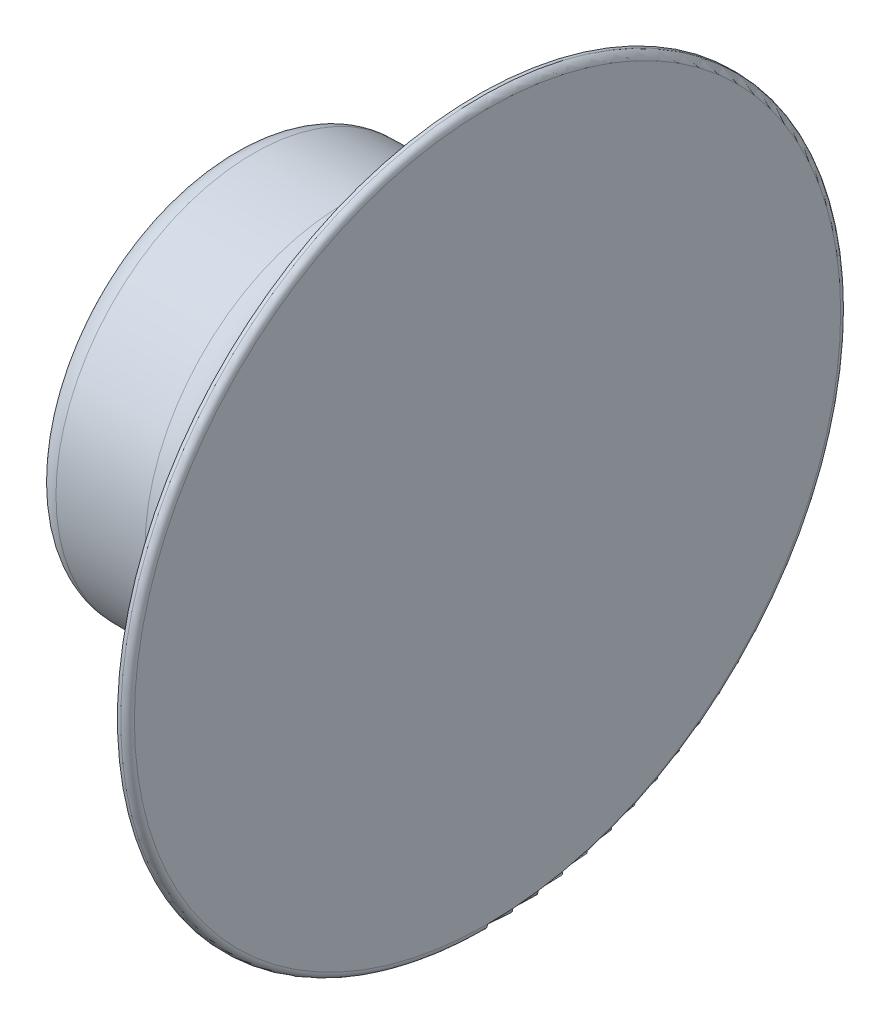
ISO-10303-21;
HEADER;
FILE_DESCRIPTION(('STEP AP214'),'2;1');
FILE_NAME('part.step','',(''),(''),'','','');
FILE_SCHEMA(('AUTOMOTIVE_DESIGN { 1 0 10303 214 1 1 1 1 }'));
ENDSEC;
DATA;
#1=APPLICATION_CONTEXT('core data for automotive mechanical design processes');
#2=APPLICATION_PROTOCOL_DEFINITION('international standard','automotive_design',2000,#1);
#3=PRODUCT_CONTEXT('',#1,'mechanical');
#4=PRODUCT('Part','Part','',(#3));
#5=PRODUCT_RELATED_PRODUCT_CATEGORY('part','',(#4));
#6=PRODUCT_DEFINITION_FORMATION('','',#4);
#7=PRODUCT_DEFINITION_CONTEXT('part definition',#1,'design');
#8=PRODUCT_DEFINITION('design','',#6,#7);
#9=PRODUCT_DEFINITION_SHAPE('','',#8);
#10=(LENGTH_UNIT() NAMED_UNIT(*) SI_UNIT(.MILLI.,.METRE.));
#11=(NAMED_UNIT(*) PLANE_ANGLE_UNIT() SI_UNIT($,.RADIAN.));
#12=(NAMED_UNIT(*) SI_UNIT($,.STERADIAN.) SOLID_ANGLE_UNIT());
#13=UNCERTAINTY_MEASURE_WITH_UNIT(LENGTH_MEASURE(1.E-05),#10,'distance_accuracy_value','');
#14=(GEOMETRIC_REPRESENTATION_CONTEXT(3) GLOBAL_UNCERTAINTY_ASSIGNED_CONTEXT((#13)) GLOBAL_UNIT_ASSIGNED_CONTEXT((#10,
#11,#12)) REPRESENTATION_CONTEXT('',''));
#15=CARTESIAN_POINT('',(0.,0.,0.));
#16=DIRECTION('',(0.,0.,1.));
#17=DIRECTION('',(1.,0.,0.));
#18=AXIS2_PLACEMENT_3D('',#15,#16,#17);
#19=CARTESIAN_POINT('',(0.,0.,0.));
#20=DIRECTION('',(1.,0.,0.));
#21=DIRECTION('',(0.,0.,-1.));
#22=AXIS2_PLACEMENT_3D('',#19,#20,#21);
#23=PLANE('',#22);
#24=CARTESIAN_POINT('',(0.,0.,0.));
#25=DIRECTION('',(1.,0.,0.));
#26=DIRECTION('',(0.,0.,-1.));
#27=AXIS2_PLACEMENT_3D('',#24,#25,#26);
#28=CIRCLE('',#27,13.208);
#29=CARTESIAN_POINT('',(0.,0.,-13.208));
#30=VERTEX_POINT('',#29);
#31=EDGE_CURVE('E22',#30,#30,#28,.T.);
#32=ORIENTED_EDGE('',*,*,#31,.T.);
#33=EDGE_LOOP('',(#32));
#34=FACE_BOUND('',#33,.T.);
#35=ADVANCED_FACE('F14',(#34),#23,.T.);
#36=CARTESIAN_POINT('',(0.,0.,0.));
#37=DIRECTION('',(1.,0.,0.));
#38=DIRECTION('',(0.,0.,-1.));
#39=AXIS2_PLACEMENT_3D('',#36,#37,#38);
#40=CYLINDRICAL_SURFACE('',#39,13.462);
#41=CARTESIAN_POINT('',(-0.254,0.,0.));
#42=DIRECTION('',(1.,0.,0.));
#43=DIRECTION('',(0.,0.,-1.));
#44=AXIS2_PLACEMENT_3D('',#41,#42,#43);
#45=CIRCLE('',#44,13.462);
#46=CARTESIAN_POINT('',(-0.254,0.,-13.462));
#47=VERTEX_POINT('',#46);
#48=EDGE_CURVE('E9',#47,#47,#45,.F.);
#49=ORIENTED_EDGE('',*,*,#48,.T.);
#50=EDGE_LOOP('',(#49));
#51=FACE_BOUND('',#50,.T.);
#52=CARTESIAN_POINT('',(-0.37846,0.,0.));
#53=DIRECTION('',(1.,0.,0.));
#54=DIRECTION('',(0.,0.,-1.));
#55=AXIS2_PLACEMENT_3D('',#52,#53,#54);
#56=CIRCLE('',#55,13.462);
#57=CARTESIAN_POINT('',(-0.37846,0.,-13.462));
#58=VERTEX_POINT('',#57);
#59=EDGE_CURVE('E50',#58,#58,#56,.T.);
#60=ORIENTED_EDGE('',*,*,#59,.T.);
#61=EDGE_LOOP('',(#60));
#62=FACE_BOUND('',#61,.T.);
#63=ADVANCED_FACE('F56',(#51,#62),#40,.T.);
#64=CARTESIAN_POINT('',(-0.37846,0.,0.));
#65=DIRECTION('',(1.,0.,0.));
#66=DIRECTION('',(0.,0.,-1.));
#67=AXIS2_PLACEMENT_3D('',#64,#65,#66);
#68=CONICAL_SURFACE('',#67,13.462,1.01219701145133);
#69=CARTESIAN_POINT('',(-3.46720074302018,0.,0.));
#70=DIRECTION('',(1.,0.,0.));
#71=DIRECTION('',(0.,0.,-1.));
#72=AXIS2_PLACEMENT_3D('',#69,#70,#71);
#73=CIRCLE('',#72,8.52001481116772);
#74=CARTESIAN_POINT('',(-3.46720074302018,0.,-8.52001481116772));
#75=VERTEX_POINT('',#74);
#76=EDGE_CURVE('E36',#75,#75,#73,.T.);
#77=ORIENTED_EDGE('',*,*,#76,.T.);
#78=EDGE_LOOP('',(#77));
#79=FACE_BOUND('',#78,.T.);
#80=ORIENTED_EDGE('',*,*,#59,.F.);
#81=EDGE_LOOP('',(#80));
#82=FACE_BOUND('',#81,.T.);
#83=ADVANCED_FACE('F58',(#79,#82),#68,.T.);
#84=CARTESIAN_POINT('',(-4.12496,0.,0.));
#85=DIRECTION('',(1.,0.,0.));
#86=DIRECTION('',(0.,0.,-1.));
#87=AXIS2_PLACEMENT_3D('',#84,#85,#86);
#88=CONICAL_SURFACE('',#87,7.4676,0.0174532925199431);
#89=CARTESIAN_POINT('',(-5.36582866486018,0.,0.));
#90=DIRECTION('',(1.,0.,0.));
#91=DIRECTION('',(0.,0.,-1.));
#92=AXIS2_PLACEMENT_3D('',#89,#90,#91);
#93=CIRCLE('',#92,7.44594055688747);
#94=CARTESIAN_POINT('',(-5.36582866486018,0.,-7.44594055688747));
#95=VERTEX_POINT('',#94);
#96=EDGE_CURVE('E30',#95,#95,#93,.F.);
#97=ORIENTED_EDGE('',*,*,#96,.T.);
#98=EDGE_LOOP('',(#97));
#99=FACE_BOUND('',#98,.T.);
#100=CARTESIAN_POINT('',(-8.7531151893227,0.,0.));
#101=DIRECTION('',(-1.,0.,0.));
#102=DIRECTION('',(0.,0.,1.));
#103=AXIS2_PLACEMENT_3D('',#100,#101,#102);
#104=CIRCLE('',#103,7.38681525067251);
#105=CARTESIAN_POINT('',(-8.7531151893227,0.,7.38681525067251));
#106=VERTEX_POINT('',#105);
#107=EDGE_CURVE('E46',#106,#106,#104,.F.);
#108=ORIENTED_EDGE('',*,*,#107,.T.);
#109=EDGE_LOOP('',(#108));
#110=FACE_BOUND('',#109,.T.);
#111=ADVANCED_FACE('F60',(#99,#110),#88,.T.);
#112=CARTESIAN_POINT('',(-9.6266,7.37156851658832,0.));
#113=DIRECTION('',(-1.,0.,0.));
#114=DIRECTION('',(0.,0.,1.));
#115=AXIS2_PLACEMENT_3D('',#112,#113,#114);
#116=PLANE('',#115);
#117=CARTESIAN_POINT('',(-9.6266,0.,0.));
#118=DIRECTION('',(-1.,0.,0.));
#119=DIRECTION('',(0.,0.,1.));
#120=AXIS2_PLACEMENT_3D('',#117,#118,#119);
#121=CIRCLE('',#120,6.49795064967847);
#122=CARTESIAN_POINT('',(-9.6266,0.,6.49795064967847));
#123=VERTEX_POINT('',#122);
#124=EDGE_CURVE('E42',#123,#123,#121,.T.);
#125=ORIENTED_EDGE('',*,*,#124,.T.);
#126=EDGE_LOOP('',(#125));
#127=FACE_BOUND('',#126,.T.);
#128=ADVANCED_FACE('F69',(#127),#116,.T.);
#129=CARTESIAN_POINT('',(-8.7376,0.,0.));
#130=DIRECTION('',(-1.,0.,0.));
#131=DIRECTION('',(0.,0.,1.));
#132=AXIS2_PLACEMENT_3D('',#129,#130,#131);
#133=TOROIDAL_SURFACE('',#132,6.49795064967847,0.889);
#134=ORIENTED_EDGE('',*,*,#124,.F.);
#135=EDGE_LOOP('',(#134));
#136=FACE_BOUND('',#135,.T.);
#137=ORIENTED_EDGE('',*,*,#107,.F.);
#138=EDGE_LOOP('',(#137));
#139=FACE_BOUND('',#138,.T.);
#140=ADVANCED_FACE('F79',(#136,#139),#133,.T.);
#141=CARTESIAN_POINT('',(-5.40572486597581,0.,0.));
#142=DIRECTION('',(1.,0.,0.));
#143=DIRECTION('',(0.,0.,-1.));
#144=AXIS2_PLACEMENT_3D('',#141,#142,#143);
#145=TOROIDAL_SURFACE('',#144,9.73159238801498,2.286);
#146=ORIENTED_EDGE('',*,*,#96,.F.);
#147=EDGE_LOOP('',(#146));
#148=FACE_BOUND('',#147,.T.);
#149=ORIENTED_EDGE('',*,*,#76,.F.);
#150=EDGE_LOOP('',(#149));
#151=FACE_BOUND('',#150,.T.);
#152=ADVANCED_FACE('F81',(#148,#151),#145,.F.);
#153=CARTESIAN_POINT('',(-0.254,0.,0.));
#154=DIRECTION('',(1.,0.,0.));
#155=DIRECTION('',(0.,0.,-1.));
#156=AXIS2_PLACEMENT_3D('',#153,#154,#155);
#157=TOROIDAL_SURFACE('',#156,13.208,0.254);
#158=ORIENTED_EDGE('',*,*,#48,.F.);
#159=EDGE_LOOP('',(#158));
#160=FACE_BOUND('',#159,.T.);
#161=ORIENTED_EDGE('',*,*,#31,.F.);
#162=EDGE_LOOP('',(#161));
#163=FACE_BOUND('',#162,.T.);
#164=ADVANCED_FACE('F16',(#160,#163),#157,.T.);
#165=CLOSED_SHELL('',(#35,#63,#83,#111,#128,#140,#152,#164));
#166=MANIFOLD_SOLID_BREP('B1',#165);
#167=ADVANCED_BREP_SHAPE_REPRESENTATION('',(#18,#166),#14);
#168=SHAPE_DEFINITION_REPRESENTATION(#9,#167);
ENDSEC;
END-ISO-10303-21;
